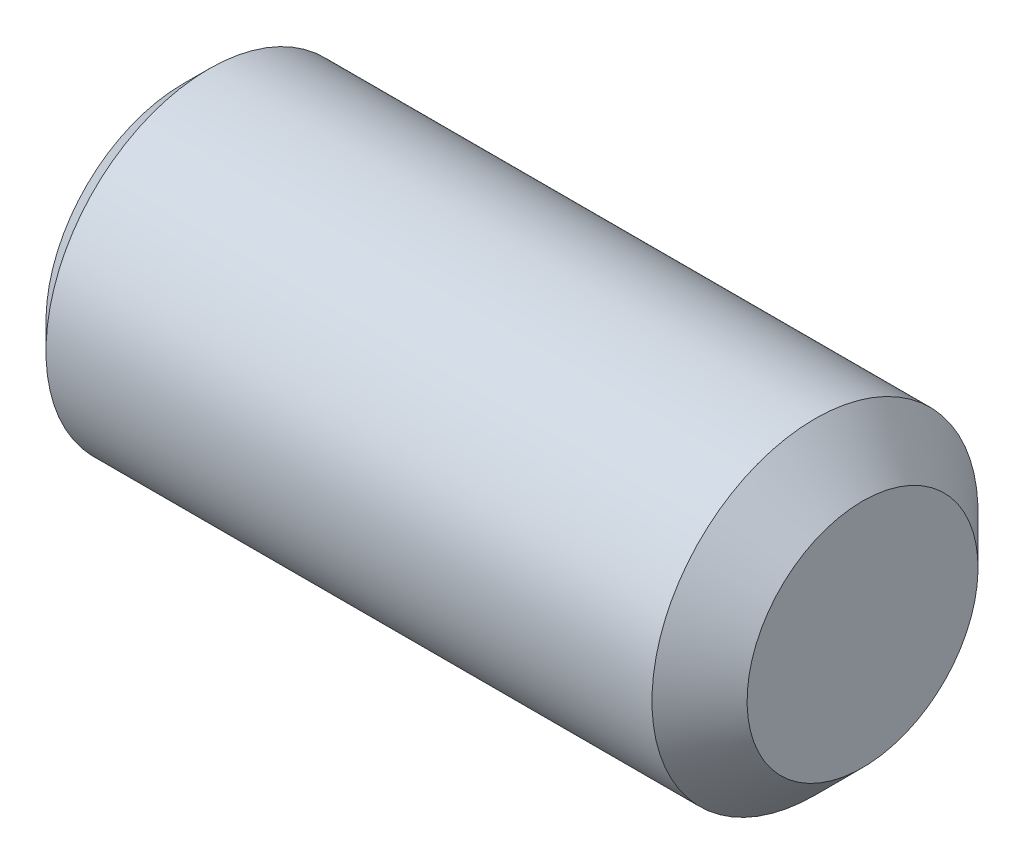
ISO-10303-21;
HEADER;
FILE_DESCRIPTION(('STEP AP214'),'2;1');
FILE_NAME('part.step','',(''),(''),'','','');
FILE_SCHEMA(('AUTOMOTIVE_DESIGN { 1 0 10303 214 1 1 1 1 }'));
ENDSEC;
DATA;
#1=APPLICATION_CONTEXT('core data for automotive mechanical design processes');
#2=APPLICATION_PROTOCOL_DEFINITION('international standard','automotive_design',2000,#1);
#3=PRODUCT_CONTEXT('',#1,'mechanical');
#4=PRODUCT('Part','Part','',(#3));
#5=PRODUCT_RELATED_PRODUCT_CATEGORY('part','',(#4));
#6=PRODUCT_DEFINITION_FORMATION('','',#4);
#7=PRODUCT_DEFINITION_CONTEXT('part definition',#1,'design');
#8=PRODUCT_DEFINITION('design','',#6,#7);
#9=PRODUCT_DEFINITION_SHAPE('','',#8);
#10=(LENGTH_UNIT() NAMED_UNIT(*) SI_UNIT(.MILLI.,.METRE.));
#11=(NAMED_UNIT(*) PLANE_ANGLE_UNIT() SI_UNIT($,.RADIAN.));
#12=(NAMED_UNIT(*) SI_UNIT($,.STERADIAN.) SOLID_ANGLE_UNIT());
#13=UNCERTAINTY_MEASURE_WITH_UNIT(LENGTH_MEASURE(1.E-05),#10,'distance_accuracy_value','');
#14=(GEOMETRIC_REPRESENTATION_CONTEXT(3) GLOBAL_UNCERTAINTY_ASSIGNED_CONTEXT((#13)) GLOBAL_UNIT_ASSIGNED_CONTEXT((#10,
#11,#12)) REPRESENTATION_CONTEXT('',''));
#15=CARTESIAN_POINT('',(0.,0.,0.));
#16=DIRECTION('',(0.,0.,1.));
#17=DIRECTION('',(1.,0.,0.));
#18=AXIS2_PLACEMENT_3D('',#15,#16,#17);
#19=CARTESIAN_POINT('',(15.877293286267,2.80372811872,1.696454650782));
#20=DIRECTION('',(1.,0.,0.));
#21=DIRECTION('',(0.,1.,0.));
#22=AXIS2_PLACEMENT_3D('',#19,#20,#21);
#23=PLANE('',#22);
#24=CARTESIAN_POINT('',(15.877293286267,2.80372811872,1.696454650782));
#25=DIRECTION('',(1.,0.,0.));
#26=DIRECTION('',(0.,1.,0.));
#27=AXIS2_PLACEMENT_3D('',#24,#25,#26);
#28=CIRCLE('',#27,4.25);
#29=CARTESIAN_POINT('',(15.877293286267,7.05372811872,1.696454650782));
#30=VERTEX_POINT('',#29);
#31=EDGE_CURVE('E10',#30,#30,#28,.T.);
#32=ORIENTED_EDGE('',*,*,#31,.T.);
#33=EDGE_LOOP('',(#32));
#34=FACE_BOUND('',#33,.T.);
#35=ADVANCED_FACE('F16',(#34),#23,.T.);
#36=CARTESIAN_POINT('',(15.002293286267,2.80372811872,1.696454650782));
#37=DIRECTION('',(-1.,0.,0.));
#38=DIRECTION('',(0.,-1.,0.));
#39=AXIS2_PLACEMENT_3D('',#36,#37,#38);
#40=CONICAL_SURFACE('',#39,5.125,0.785398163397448);
#41=ORIENTED_EDGE('',*,*,#31,.F.);
#42=EDGE_LOOP('',(#41));
#43=FACE_BOUND('',#42,.T.);
#44=CARTESIAN_POINT('',(14.127293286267,2.80372811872,1.696454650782));
#45=DIRECTION('',(1.,0.,0.));
#46=DIRECTION('',(0.,1.,0.));
#47=AXIS2_PLACEMENT_3D('',#44,#45,#46);
#48=CIRCLE('',#47,6.);
#49=CARTESIAN_POINT('',(14.127293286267,8.80372811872,1.696454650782));
#50=VERTEX_POINT('',#49);
#51=EDGE_CURVE('E27',#50,#50,#48,.T.);
#52=ORIENTED_EDGE('',*,*,#51,.T.);
#53=EDGE_LOOP('',(#52));
#54=FACE_BOUND('',#53,.T.);
#55=ADVANCED_FACE('F308',(#43,#54),#40,.T.);
#56=CARTESIAN_POINT('',(-1.122706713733,2.80372811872,1.696454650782));
#57=DIRECTION('',(-1.,0.,0.));
#58=DIRECTION('',(0.,0.,1.));
#59=AXIS2_PLACEMENT_3D('',#56,#57,#58);
#60=PLANE('',#59);
#61=DIRECTION('',(0.,-0.500000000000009,-0.866025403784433));
#62=VECTOR('',#61,1.);
#63=CARTESIAN_POINT('',(-1.122706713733,6.26782973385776,1.69645465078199));
#64=LINE('',#63,#62);
#65=CARTESIAN_POINT('',(-1.122706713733,6.26782973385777,1.696454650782));
#66=VERTEX_POINT('',#65);
#67=CARTESIAN_POINT('',(-1.122706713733,4.53577892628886,-1.303545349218));
#68=VERTEX_POINT('',#67);
#69=EDGE_CURVE('E20',#66,#68,#64,.T.);
#70=ORIENTED_EDGE('',*,*,#69,.T.);
#71=DIRECTION('',(0.,-1.,0.));
#72=VECTOR('',#71,1.);
#73=CARTESIAN_POINT('',(-1.122706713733,4.53577892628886,-1.303545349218));
#74=LINE('',#73,#72);
#75=CARTESIAN_POINT('',(-1.122706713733,1.07167731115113,-1.303545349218));
#76=VERTEX_POINT('',#75);
#77=EDGE_CURVE('E101',#68,#76,#74,.T.);
#78=ORIENTED_EDGE('',*,*,#77,.T.);
#79=DIRECTION('',(0.,-0.5,0.866025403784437));
#80=VECTOR('',#79,1.);
#81=CARTESIAN_POINT('',(-1.122706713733,1.07167731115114,-1.303545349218));
#82=LINE('',#81,#80);
#83=CARTESIAN_POINT('',(-1.122706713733,-0.66037349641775,1.696454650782));
#84=VERTEX_POINT('',#83);
#85=EDGE_CURVE('E158',#76,#84,#82,.T.);
#86=ORIENTED_EDGE('',*,*,#85,.T.);
#87=DIRECTION('',(0.,0.499999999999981,0.86602540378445));
#88=VECTOR('',#87,1.);
#89=CARTESIAN_POINT('',(-1.122706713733,-0.66037349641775,1.696454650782));
#90=LINE('',#89,#88);
#91=CARTESIAN_POINT('',(-1.122706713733,1.07167731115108,4.696454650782));
#92=VERTEX_POINT('',#91);
#93=EDGE_CURVE('E143',#84,#92,#90,.T.);
#94=ORIENTED_EDGE('',*,*,#93,.T.);
#95=DIRECTION('',(0.,1.,0.));
#96=VECTOR('',#95,1.);
#97=CARTESIAN_POINT('',(-1.122706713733,1.07167731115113,4.696454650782));
#98=LINE('',#97,#96);
#99=CARTESIAN_POINT('',(-1.122706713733,4.53577892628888,4.69645465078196));
#100=VERTEX_POINT('',#99);
#101=EDGE_CURVE('E180',#92,#100,#98,.T.);
#102=ORIENTED_EDGE('',*,*,#101,.T.);
#103=DIRECTION('',(0.,0.500000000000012,-0.866025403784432));
#104=VECTOR('',#103,1.);
#105=CARTESIAN_POINT('',(-1.122706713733,4.53577892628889,4.69645465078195));
#106=LINE('',#105,#104);
#107=EDGE_CURVE('E92',#100,#66,#106,.T.);
#108=ORIENTED_EDGE('',*,*,#107,.T.);
#109=EDGE_LOOP('',(#70,#78,#86,#94,#102,#108));
#110=FACE_BOUND('',#109,.T.);
#111=ADVANCED_FACE('F18',(#110),#60,.T.);
#112=CARTESIAN_POINT('',(-8.17549142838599,2.80372811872,1.696454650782));
#113=DIRECTION('',(1.,0.,0.));
#114=DIRECTION('',(0.,1.,0.));
#115=AXIS2_PLACEMENT_3D('',#112,#113,#114);
#116=CYLINDRICAL_SURFACE('',#115,6.);
#117=ORIENTED_EDGE('',*,*,#51,.F.);
#118=EDGE_LOOP('',(#117));
#119=FACE_BOUND('',#118,.T.);
#120=CARTESIAN_POINT('',(-8.17549142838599,2.80372811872,1.696454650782));
#121=DIRECTION('',(1.,0.,0.));
#122=DIRECTION('',(0.,1.,0.));
#123=AXIS2_PLACEMENT_3D('',#120,#121,#122);
#124=CIRCLE('',#123,6.);
#125=CARTESIAN_POINT('',(-8.17549142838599,8.80372811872,1.696454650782));
#126=VERTEX_POINT('',#125);
#127=EDGE_CURVE('E130',#126,#126,#124,.T.);
#128=ORIENTED_EDGE('',*,*,#127,.T.);
#129=EDGE_LOOP('',(#128));
#130=FACE_BOUND('',#129,.T.);
#131=ADVANCED_FACE('F317',(#119,#130),#116,.T.);
#132=CARTESIAN_POINT('',(-8.53011880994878,2.80372811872,1.696454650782));
#133=DIRECTION('',(-1.,0.,0.));
#134=DIRECTION('',(0.,-1.,0.));
#135=AXIS2_PLACEMENT_3D('',#132,#133,#134);
#136=CONICAL_SURFACE('',#135,4.026392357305,1.0471975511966);
#137=CARTESIAN_POINT('',(-8.20548010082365,4.53577892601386,4.69645465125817));
#138=CARTESIAN_POINT('',(-8.20063730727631,4.54416689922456,4.68192625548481));
#139=CARTESIAN_POINT('',(-8.19099572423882,4.56105037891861,4.65268321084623));
#140=CARTESIAN_POINT('',(-8.17675918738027,4.58655868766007,4.60850152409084));
#141=CARTESIAN_POINT('',(-8.16263851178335,4.61248183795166,4.56360131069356));
#142=CARTESIAN_POINT('',(-8.14865833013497,4.63882102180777,4.51798050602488));
#143=CARTESIAN_POINT('',(-8.13310004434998,4.66895645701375,4.46578440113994));
#144=CARTESIAN_POINT('',(-8.1144819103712,4.70630695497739,4.40109144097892));
#145=CARTESIAN_POINT('',(-8.09132186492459,4.75516583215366,4.31646538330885));
#146=CARTESIAN_POINT('',(-8.06550616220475,4.81363476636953,4.21519421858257));
#147=CARTESIAN_POINT('',(-8.04044675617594,4.87596923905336,4.10722774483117));
#148=CARTESIAN_POINT('',(-8.01917204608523,4.93485583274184,4.00523317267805));
#149=CARTESIAN_POINT('',(-8.00279542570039,4.98537438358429,3.91773247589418));
#150=CARTESIAN_POINT('',(-7.98978125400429,5.02987279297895,3.84065896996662));
#151=CARTESIAN_POINT('',(-7.97869607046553,5.07195688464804,3.76776718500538));
#152=CARTESIAN_POINT('',(-7.96856697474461,5.11546163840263,3.69241474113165));
#153=CARTESIAN_POINT('',(-7.95945885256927,5.16091293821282,3.61369078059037));
#154=CARTESIAN_POINT('',(-7.95166113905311,5.20786895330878,3.5323605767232));
#155=CARTESIAN_POINT('',(-7.94535460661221,5.2563250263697,3.44843219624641));
#156=CARTESIAN_POINT('',(-7.94075696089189,5.30577435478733,3.36278344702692));
#157=CARTESIAN_POINT('',(-7.93809713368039,5.35443863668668,3.27849443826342));
#158=CARTESIAN_POINT('',(-7.9374991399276,5.38832642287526,3.21979907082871));
#159=CARTESIAN_POINT('',(-7.93757036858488,5.42258608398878,3.16045959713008));
#160=CARTESIAN_POINT('',(-7.93844703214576,5.4591061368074,3.09720501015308));
#161=CARTESIAN_POINT('',(-7.94180737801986,5.5115977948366,3.006286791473));
#162=CARTESIAN_POINT('',(-7.94738342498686,5.56496821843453,2.9138465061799));
#163=CARTESIAN_POINT('',(-7.95521348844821,5.61891325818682,2.82041095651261));
#164=CARTESIAN_POINT('',(-7.96530293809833,5.67326089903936,2.72627808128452));
#165=CARTESIAN_POINT('',(-7.97758455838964,5.72770487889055,2.63197834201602));
#166=CARTESIAN_POINT('',(-7.99201507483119,5.78221265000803,2.53756811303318));
#167=CARTESIAN_POINT('',(-8.00850762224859,5.83665128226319,2.4432776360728));
#168=CARTESIAN_POINT('',(-8.02698948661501,5.89099685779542,2.34914833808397));
#169=CARTESIAN_POINT('',(-8.04736912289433,5.94520120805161,2.25526364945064));
#170=CARTESIAN_POINT('',(-8.06957819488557,5.99928745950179,2.1615835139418));
#171=CARTESIAN_POINT('',(-8.09353879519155,6.05325581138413,2.06810758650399));
#172=CARTESIAN_POINT('',(-8.11917131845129,6.10710587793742,1.97483653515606));
#173=CARTESIAN_POINT('',(-8.14639537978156,6.16083557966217,1.88177396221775));
#174=CARTESIAN_POINT('',(-8.17513052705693,6.21444250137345,1.78892404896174));
#175=CARTESIAN_POINT('',(-8.19521536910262,6.2500505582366,1.72724908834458));
#176=CARTESIAN_POINT('',(-8.20548010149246,6.26782973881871,1.69645464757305));
#177=(BOUNDED_CURVE() B_SPLINE_CURVE(3,(#137,#138,#139,#140,#141,#142,#143,#144,#145,#146,#147,
#148,#149,#150,#151,#152,#153,#154,#155,#156,#157,#158,#159,#160,#161,#162,#163,#164,#165,#166,
#167,#168,#169,#170,#171,#172,#173,#174,#175,#176),.UNSPECIFIED.,.F.,
.F.) B_SPLINE_CURVE_WITH_KNOTS((4,1,1,1,1,1,1,1,1,1,1,1,1,1,1,1,1,1,1,1,1,1,1,1,1,1,1,1,1,1,1,1,
1,1,1,1,1,4),(0.,0.0149058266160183,0.0299738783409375,0.0451999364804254,0.0607545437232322,
0.0764711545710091,0.0982995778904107,0.126423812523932,0.162134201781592,0.200462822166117,
0.234916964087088,0.264240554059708,0.287778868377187,0.311629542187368,0.336627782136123,
0.362458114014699,0.389510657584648,0.416964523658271,0.445261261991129,0.473935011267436,
0.500001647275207,0.503073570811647,0.532385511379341,0.562314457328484,0.592679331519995,
0.623561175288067,0.65457172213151,0.68575580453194,0.716970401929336,0.74829502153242,
0.7796008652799,0.810931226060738,0.842309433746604,0.873730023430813,0.905197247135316,
0.936733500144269,0.968333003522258,1.),
.UNSPECIFIED.) CURVE() GEOMETRIC_REPRESENTATION_ITEM() RATIONAL_B_SPLINE_CURVE((1.,1.,1.,1.,1.,
1.,1.,1.,1.,1.,1.,1.,1.,1.,1.,1.,1.,1.,1.,1.,1.,1.,1.,1.,1.,1.,1.,1.,1.,1.,1.,1.,1.,1.,1.,1.,1.,
1.,1.,1.)) REPRESENTATION_ITEM(''));
#178=CARTESIAN_POINT('',(-8.2054801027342,4.53577892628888,4.69645465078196));
#179=VERTEX_POINT('',#178);
#180=CARTESIAN_POINT('',(-8.20548010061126,6.26782973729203,1.6964546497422));
#181=VERTEX_POINT('',#180);
#182=EDGE_CURVE('E172',#179,#181,#177,.T.);
#183=ORIENTED_EDGE('',*,*,#182,.F.);
#184=CARTESIAN_POINT('',(-8.20548009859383,1.07167731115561,4.69645465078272));
#185=CARTESIAN_POINT('',(-8.20063730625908,1.08845325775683,4.69645465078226));
#186=CARTESIAN_POINT('',(-8.19099572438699,1.12222021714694,4.69645465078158));
#187=CARTESIAN_POINT('',(-8.17675918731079,1.17323683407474,4.69645465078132));
#188=CARTESIAN_POINT('',(-8.1648353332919,1.21701715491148,4.69645465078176));
#189=CARTESIAN_POINT('',(-8.15552841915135,1.25187449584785,4.69645465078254));
#190=CARTESIAN_POINT('',(-8.14619075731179,1.28732057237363,4.69645465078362));
#191=CARTESIAN_POINT('',(-8.13310004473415,1.33803237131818,4.69645465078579));
#192=CARTESIAN_POINT('',(-8.11448191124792,1.41273336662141,4.6964546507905));
#193=CARTESIAN_POINT('',(-8.09132186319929,1.51045111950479,4.69645465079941));
#194=CARTESIAN_POINT('',(-8.07100445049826,1.60248333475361,4.69645465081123));
#195=CARTESIAN_POINT('',(-8.05343065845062,1.68746376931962,4.69645465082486));
#196=CARTESIAN_POINT('',(-8.03699433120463,1.77117002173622,4.6964546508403));
#197=CARTESIAN_POINT('',(-8.01917204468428,1.8698311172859,4.69645465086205));
#198=CARTESIAN_POINT('',(-8.00456103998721,1.9599751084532,4.69645465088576));
#199=CARTESIAN_POINT('',(-7.99542452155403,2.02127380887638,4.69645465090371));
#200=CARTESIAN_POINT('',(-7.98795066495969,2.07394573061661,4.69645465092));
#201=CARTESIAN_POINT('',(-7.98283324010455,2.11262026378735,4.69645465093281));
#202=CARTESIAN_POINT('',(-7.97832006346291,2.14876571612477,4.69645465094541));
#203=CARTESIAN_POINT('',(-7.97448350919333,2.18021921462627,4.69645465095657));
#204=CARTESIAN_POINT('',(-7.97106787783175,2.21015203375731,4.69645465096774));
#205=CARTESIAN_POINT('',(-7.96556319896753,2.2610215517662,4.6964546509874));
#206=CARTESIAN_POINT('',(-7.96116343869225,2.30503106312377,4.69645465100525));
#207=CARTESIAN_POINT('',(-7.95579911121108,2.3660211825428,4.69645465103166));
#208=CARTESIAN_POINT('',(-7.95075678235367,2.42975484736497,4.69645465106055));
#209=CARTESIAN_POINT('',(-7.94535459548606,2.51276950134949,4.69645465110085));
#210=CARTESIAN_POINT('',(-7.94215360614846,2.58162560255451,4.69645465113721));
#211=CARTESIAN_POINT('',(-7.93975355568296,2.64838426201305,4.69645465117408));
#212=CARTESIAN_POINT('',(-7.93806581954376,2.71254664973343,4.69645465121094));
#213=CARTESIAN_POINT('',(-7.93749913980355,2.77677229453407,4.69645465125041));
#214=CARTESIAN_POINT('',(-7.93757036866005,2.84529161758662,4.69645465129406));
#215=CARTESIAN_POINT('',(-7.93844703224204,2.91833172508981,4.69645465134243));
#216=CARTESIAN_POINT('',(-7.94180737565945,3.02331500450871,4.69645465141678));
#217=CARTESIAN_POINT('',(-7.94550849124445,3.09416450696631,4.69645465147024));
#218=CARTESIAN_POINT('',(-7.94997957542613,3.16582812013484,4.69645465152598));
#219=CARTESIAN_POINT('',(-7.95523779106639,3.23820778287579,4.69645465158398));
#220=CARTESIAN_POINT('',(-7.9653029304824,3.34664123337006,4.69645465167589));
#221=CARTESIAN_POINT('',(-7.9746123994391,3.42917814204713,4.69645465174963));
#222=CARTESIAN_POINT('',(-7.98178868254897,3.48646575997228,4.69645465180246));
#223=CARTESIAN_POINT('',(-7.98626237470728,3.52064652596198,4.69645465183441));
#224=CARTESIAN_POINT('',(-7.98987015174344,3.54692246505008,4.69645465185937));
#225=CARTESIAN_POINT('',(-7.99528825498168,3.58525735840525,4.69645465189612));
#226=CARTESIAN_POINT('',(-8.00098240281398,3.6237437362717,4.69645465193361));
#227=CARTESIAN_POINT('',(-8.01240442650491,3.69633884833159,4.69645465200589));
#228=CARTESIAN_POINT('',(-8.02091517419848,3.74639037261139,4.69645465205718));
#229=CARTESIAN_POINT('',(-8.033873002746,3.81872977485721,4.69645465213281));
#230=CARTESIAN_POINT('',(-8.04747503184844,3.89103772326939,4.69645465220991));
#231=CARTESIAN_POINT('',(-8.06789658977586,3.99050386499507,4.69645465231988));
#232=CARTESIAN_POINT('',(-8.08372883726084,4.06243961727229,4.69645465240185));
#233=CARTESIAN_POINT('',(-8.10013352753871,4.13434014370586,4.69645465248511));
#234=CARTESIAN_POINT('',(-8.11917131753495,4.21433120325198,4.69645465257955));
#235=CARTESIAN_POINT('',(-8.14461727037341,4.31477206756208,4.69645465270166));
#236=CARTESIAN_POINT('',(-8.16365929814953,4.38620402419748,4.69645465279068));
#237=CARTESIAN_POINT('',(-8.18320065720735,4.45761929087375,4.69645465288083));
#238=CARTESIAN_POINT('',(-8.19521532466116,4.50022056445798,4.69645465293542));
#239=CARTESIAN_POINT('',(-8.20548009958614,4.53577892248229,4.69645465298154));
#240=(BOUNDED_CURVE() B_SPLINE_CURVE(3,(#184,#185,#186,#187,#188,#189,#190,#191,#192,#193,#194,
#195,#196,#197,#198,#199,#200,#201,#202,#203,#204,#205,#206,#207,#208,#209,#210,#211,#212,#213,
#214,#215,#216,#217,#218,#219,#220,#221,#222,#223,#224,#225,#226,#227,#228,#229,#230,#231,#232,
#233,#234,#235,#236,#237,#238,#239),.UNSPECIFIED.,.F.,.F.) B_SPLINE_CURVE_WITH_KNOTS((4,1,1,1,1,
1,1,1,1,1,1,1,1,1,1,1,1,1,1,1,1,1,1,1,1,1,1,1,1,1,1,1,1,1,1,1,1,1,1,1,1,1,1,1,1,1,1,1,1,1,1,1,1,
4),(0.,0.0149058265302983,0.0299738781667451,0.0451999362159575,0.0536216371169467,
0.0607545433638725,0.0764711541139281,0.0982995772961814,0.126423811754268,0.162134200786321,
0.178703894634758,0.200462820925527,0.234916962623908,0.264240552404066,0.278365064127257,
0.287778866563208,0.30961167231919,0.311629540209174,0.318836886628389,0.336627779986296,
0.337314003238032,0.362458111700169,0.374332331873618,0.389510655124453,0.416964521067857,
0.44526125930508,0.448289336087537,0.473935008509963,0.500001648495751,0.503073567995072,
0.532385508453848,0.562314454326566,0.592679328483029,0.592903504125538,0.623561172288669,
0.654571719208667,0.685755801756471,0.694365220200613,0.703784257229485,0.715137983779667,
0.716970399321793,0.736781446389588,0.748295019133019,0.779600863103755,0.780049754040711,
0.810931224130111,0.842309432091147,0.866602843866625,0.873730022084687,0.905197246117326,
0.936733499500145,0.962154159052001,0.968333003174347,1.),
.UNSPECIFIED.) CURVE() GEOMETRIC_REPRESENTATION_ITEM() RATIONAL_B_SPLINE_CURVE((1.,1.,1.,1.,1.,
1.,1.,1.,1.,1.,1.,1.,1.,1.,1.,1.,1.,1.,1.,1.,1.,1.,1.,1.,1.,1.,1.,1.,1.,1.,1.,1.,1.,1.,1.,1.,1.,
1.,1.,1.,1.,1.,1.,1.,1.,1.,1.,1.,1.,1.,1.,1.,1.,1.,1.,1.)) REPRESENTATION_ITEM(''));
#241=CARTESIAN_POINT('',(-8.20548009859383,1.07167731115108,4.696454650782));
#242=VERTEX_POINT('',#241);
#243=EDGE_CURVE('E165',#242,#179,#240,.T.);
#244=ORIENTED_EDGE('',*,*,#243,.F.);
#245=CARTESIAN_POINT('',(-8.20548009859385,-0.66037349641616,1.69645465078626));
#246=CARTESIAN_POINT('',(-8.20063730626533,-0.65198552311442,1.71098304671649));
#247=CARTESIAN_POINT('',(-8.19099572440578,-0.63510204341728,1.74022609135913));
#248=CARTESIAN_POINT('',(-8.17675918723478,-0.60959373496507,1.78440777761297));
#249=CARTESIAN_POINT('',(-8.16263851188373,-0.58367058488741,1.82930799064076));
#250=CARTESIAN_POINT('',(-8.14865833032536,-0.55733140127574,1.87492879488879));
#251=CARTESIAN_POINT('',(-8.13310004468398,-0.5271959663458,1.92712489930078));
#252=CARTESIAN_POINT('',(-8.11448191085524,-0.48984546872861,1.99181785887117));
#253=CARTESIAN_POINT('',(-8.09132186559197,-0.44098659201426,2.07644391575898));
#254=CARTESIAN_POINT('',(-8.06550616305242,-0.38251765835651,2.17771507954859));
#255=CARTESIAN_POINT('',(-8.04044675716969,-0.32018318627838,2.28568155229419));
#256=CARTESIAN_POINT('',(-8.01917204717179,-0.26129659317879,2.38767612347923));
#257=CARTESIAN_POINT('',(-8.00279542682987,-0.21077804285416,2.47517681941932));
#258=CARTESIAN_POINT('',(-7.98978125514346,-0.16627963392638,2.55225032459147));
#259=CARTESIAN_POINT('',(-7.97869607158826,-0.12419554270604,2.62514210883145));
#260=CARTESIAN_POINT('',(-7.96856697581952,-0.08069078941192,2.70049455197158));
#261=CARTESIAN_POINT('',(-7.95945885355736,-0.03523949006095,2.77921851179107));
#262=CARTESIAN_POINT('',(-7.95166113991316,0.0117165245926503,2.86054871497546));
#263=CARTESIAN_POINT('',(-7.94535460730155,0.06017259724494,2.94447709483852));
#264=CARTESIAN_POINT('',(-7.94075696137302,0.10962192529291,3.03012584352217));
#265=CARTESIAN_POINT('',(-7.93809713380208,0.15828620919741,3.11441485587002));
#266=CARTESIAN_POINT('',(-7.93749913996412,0.19217399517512,3.17311022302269));
#267=CARTESIAN_POINT('',(-7.93757036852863,0.22643365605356,3.2324496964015));
#268=CARTESIAN_POINT('',(-7.93844703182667,0.262953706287,3.29570427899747));
#269=CARTESIAN_POINT('',(-7.9418073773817,0.31544536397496,3.38662249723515));
#270=CARTESIAN_POINT('',(-7.94738342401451,0.36881578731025,3.47906278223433));
#271=CARTESIAN_POINT('',(-7.95521348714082,0.4227608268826,3.57249833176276));
#272=CARTESIAN_POINT('',(-7.9653029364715,0.47710846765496,3.66663120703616));
#273=CARTESIAN_POINT('',(-7.97758455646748,0.53155244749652,3.76093094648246));
#274=CARTESIAN_POINT('',(-7.99201507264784,0.5860602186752,3.85534117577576));
#275=CARTESIAN_POINT('',(-8.00850761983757,0.640498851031,3.94963165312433));
#276=CARTESIAN_POINT('',(-8.02698948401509,0.69484442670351,4.04376095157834));
#277=CARTESIAN_POINT('',(-8.04736912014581,0.74904877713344,4.13764564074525));
#278=CARTESIAN_POINT('',(-8.06957819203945,0.80313502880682,4.23132577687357));
#279=CARTESIAN_POINT('',(-8.09353879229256,0.85710338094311,4.32480170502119));
#280=CARTESIAN_POINT('',(-8.11917131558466,0.91095344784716,4.41807275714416));
#281=CARTESIAN_POINT('',(-8.14639537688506,0.96468314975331,4.5111353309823));
#282=CARTESIAN_POINT('',(-8.17513052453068,1.01829007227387,4.6039852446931));
#283=CARTESIAN_POINT('',(-8.19521536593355,1.05389812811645,4.66566020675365));
#284=CARTESIAN_POINT('',(-8.20548009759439,1.07167730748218,4.69645464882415));
#285=(BOUNDED_CURVE() B_SPLINE_CURVE(3,(#245,#246,#247,#248,#249,#250,#251,#252,#253,#254,#255,
#256,#257,#258,#259,#260,#261,#262,#263,#264,#265,#266,#267,#268,#269,#270,#271,#272,#273,#274,
#275,#276,#277,#278,#279,#280,#281,#282,#283,#284),.UNSPECIFIED.,.F.,
.F.) B_SPLINE_CURVE_WITH_KNOTS((4,1,1,1,1,1,1,1,1,1,1,1,1,1,1,1,1,1,1,1,1,1,1,1,1,1,1,1,1,1,1,1,
1,1,1,1,1,4),(0.,0.0149058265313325,0.0299738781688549,0.0451999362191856,0.0607545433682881,
0.0764711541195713,0.0982995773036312,0.126423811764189,0.162134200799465,0.20046282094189,
0.234916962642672,0.264240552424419,0.287778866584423,0.311629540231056,0.336627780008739,
0.362458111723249,0.389510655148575,0.416964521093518,0.445261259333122,0.473935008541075,
0.500001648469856,0.503073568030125,0.532385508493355,0.56231445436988,0.592679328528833,
0.623561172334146,0.654571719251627,0.685755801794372,0.71697039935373,0.748295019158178,
0.7796008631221,0.810931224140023,0.8423094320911,0.873730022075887,0.905197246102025,
0.936733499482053,0.968333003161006,1.),
.UNSPECIFIED.) CURVE() GEOMETRIC_REPRESENTATION_ITEM() RATIONAL_B_SPLINE_CURVE((1.,1.,1.,1.,1.,
1.,1.,1.,1.,1.,1.,1.,1.,1.,1.,1.,1.,1.,1.,1.,1.,1.,1.,1.,1.,1.,1.,1.,1.,1.,1.,1.,1.,1.,1.,1.,1.,
1.,1.,1.)) REPRESENTATION_ITEM(''));
#286=CARTESIAN_POINT('',(-8.20548009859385,-0.66037349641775,1.696454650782));
#287=VERTEX_POINT('',#286);
#288=EDGE_CURVE('E188',#287,#242,#285,.T.);
#289=ORIENTED_EDGE('',*,*,#288,.F.);
#290=CARTESIAN_POINT('',(-8.20548009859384,1.07167731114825,-1.30354534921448));
#291=CARTESIAN_POINT('',(-8.20063730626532,1.0632893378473,-1.28901695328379));
#292=CARTESIAN_POINT('',(-8.19099572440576,1.04640585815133,-1.25977390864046));
#293=CARTESIAN_POINT('',(-8.17675918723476,1.02089754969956,-1.21559222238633));
#294=CARTESIAN_POINT('',(-8.1626385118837,0.99497439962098,-1.17069200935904));
#295=CARTESIAN_POINT('',(-8.14865833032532,0.96863521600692,-1.12507120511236));
#296=CARTESIAN_POINT('',(-8.13310004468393,0.93849978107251,-1.07287510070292));
#297=CARTESIAN_POINT('',(-8.11448191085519,0.90114928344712,-1.00818214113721));
#298=CARTESIAN_POINT('',(-8.09132186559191,0.85229040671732,-0.92355608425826));
#299=CARTESIAN_POINT('',(-8.06550616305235,0.79382147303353,-0.82228492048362));
#300=CARTESIAN_POINT('',(-8.04044675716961,0.73148700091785,-0.71431844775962));
#301=CARTESIAN_POINT('',(-8.0191720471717,0.67260040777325,-0.61232387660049));
#302=CARTESIAN_POINT('',(-8.00279542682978,0.62208185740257,-0.52482318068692));
#303=CARTESIAN_POINT('',(-7.98978125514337,0.57758344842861,-0.44774967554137));
#304=CARTESIAN_POINT('',(-7.97869607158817,0.53549935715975,-0.37485789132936));
#305=CARTESIAN_POINT('',(-7.96856697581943,0.49199460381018,-0.29950544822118));
#306=CARTESIAN_POINT('',(-7.95945885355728,0.44654330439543,-0.22078148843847));
#307=CARTESIAN_POINT('',(-7.95166113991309,0.39958728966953,-0.13945128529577));
#308=CARTESIAN_POINT('',(-7.94535460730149,0.35113121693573,-0.05552290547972));
#309=CARTESIAN_POINT('',(-7.94075696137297,0.30168188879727,0.0301258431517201));
#310=CARTESIAN_POINT('',(-7.93809713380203,0.25301760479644,0.11441485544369));
#311=CARTESIAN_POINT('',(-7.93749913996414,0.21912981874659,0.17311022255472));
#312=CARTESIAN_POINT('',(-7.93757036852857,0.18487015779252,0.23244969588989));
#313=CARTESIAN_POINT('',(-7.93844703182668,0.14835010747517,0.29570427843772));
#314=CARTESIAN_POINT('',(-7.94180737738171,0.0958584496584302,0.38662249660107));
#315=CARTESIAN_POINT('',(-7.94738342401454,0.0424880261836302,0.47906278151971));
#316=CARTESIAN_POINT('',(-7.95521348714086,-0.0114570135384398,0.5724983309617));
#317=CARTESIAN_POINT('',(-7.96530293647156,-0.0658046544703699,0.66663120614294));
#318=CARTESIAN_POINT('',(-7.97758455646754,-0.12024863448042,0.76093094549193));
#319=CARTESIAN_POINT('',(-7.99201507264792,-0.17475640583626,0.855341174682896));
#320=CARTESIAN_POINT('',(-8.00850761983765,-0.22919503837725,0.949631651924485));
#321=CARTESIAN_POINT('',(-8.02698948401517,-0.28354061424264,1.04376095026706));
#322=CARTESIAN_POINT('',(-8.04736912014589,-0.33774496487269,1.13764563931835));
#323=CARTESIAN_POINT('',(-8.06957819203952,-0.39183121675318,1.23132577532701));
#324=CARTESIAN_POINT('',(-8.09353879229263,-0.44579956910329,1.3248017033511));
#325=CARTESIAN_POINT('',(-8.11917131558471,-0.49964963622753,1.41807275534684));
#326=CARTESIAN_POINT('',(-8.1463953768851,-0.55337933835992,1.51113532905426));
#327=CARTESIAN_POINT('',(-8.17513052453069,-0.60698626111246,1.60398524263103));
#328=CARTESIAN_POINT('',(-8.19521536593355,-0.6425943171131,1.66566020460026));
#329=CARTESIAN_POINT('',(-8.20548009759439,-0.66037349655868,1.69645464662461));
#330=(BOUNDED_CURVE() B_SPLINE_CURVE(3,(#290,#291,#292,#293,#294,#295,#296,#297,#298,#299,#300,
#301,#302,#303,#304,#305,#306,#307,#308,#309,#310,#311,#312,#313,#314,#315,#316,#317,#318,#319,
#320,#321,#322,#323,#324,#325,#326,#327,#328,#329),.UNSPECIFIED.,.F.,
.F.) B_SPLINE_CURVE_WITH_KNOTS((4,1,1,1,1,1,1,1,1,1,1,1,1,1,1,1,1,1,1,1,1,1,1,1,1,1,1,1,1,1,1,1,
1,1,1,1,1,4),(0.,0.0149058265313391,0.0299738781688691,0.045199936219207,0.0607545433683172,
0.0764711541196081,0.0982995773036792,0.12642381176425,0.162134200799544,0.200462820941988,
0.234916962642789,0.264240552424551,0.287778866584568,0.311629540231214,0.336627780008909,
0.362458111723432,0.389510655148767,0.416964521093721,0.445261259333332,0.473935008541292,
0.50000164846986,0.503073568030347,0.532385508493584,0.562314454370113,0.592679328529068,
0.623561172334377,0.654571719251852,0.685755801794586,0.716970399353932,0.748295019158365,
0.77960086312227,0.810931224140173,0.842309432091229,0.873730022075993,0.905197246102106,
0.936733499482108,0.968333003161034,1.),
.UNSPECIFIED.) CURVE() GEOMETRIC_REPRESENTATION_ITEM() RATIONAL_B_SPLINE_CURVE((1.,1.,1.,1.,1.,
1.,1.,1.,1.,1.,1.,1.,1.,1.,1.,1.,1.,1.,1.,1.,1.,1.,1.,1.,1.,1.,1.,1.,1.,1.,1.,1.,1.,1.,1.,1.,1.,
1.,1.,1.)) REPRESENTATION_ITEM(''));
#331=CARTESIAN_POINT('',(-8.20548009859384,1.07167731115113,-1.303545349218));
#332=VERTEX_POINT('',#331);
#333=EDGE_CURVE('E114',#332,#287,#330,.T.);
#334=ORIENTED_EDGE('',*,*,#333,.F.);
#335=CARTESIAN_POINT('',(-8.20548009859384,4.53577892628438,-1.30354534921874));
#336=CARTESIAN_POINT('',(-8.20063730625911,4.51900297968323,-1.30354534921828));
#337=CARTESIAN_POINT('',(-8.19099572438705,4.48523602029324,-1.3035453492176));
#338=CARTESIAN_POINT('',(-8.1767591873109,4.43421940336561,-1.30354534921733));
#339=CARTESIAN_POINT('',(-8.16483533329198,4.39043908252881,-1.30354534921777));
#340=CARTESIAN_POINT('',(-8.15552841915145,4.35558174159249,-1.30354534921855));
#341=CARTESIAN_POINT('',(-8.14619075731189,4.32013566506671,-1.30354534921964));
#342=CARTESIAN_POINT('',(-8.13310004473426,4.26942386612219,-1.3035453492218));
#343=CARTESIAN_POINT('',(-8.11448191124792,4.19472287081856,-1.30354534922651));
#344=CARTESIAN_POINT('',(-8.09132186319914,4.09700511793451,-1.30354534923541));
#345=CARTESIAN_POINT('',(-8.07100445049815,4.0049729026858,-1.30354534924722));
#346=CARTESIAN_POINT('',(-8.05343065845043,3.91999246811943,-1.30354534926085));
#347=CARTESIAN_POINT('',(-8.03699433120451,3.8362862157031,-1.30354534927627));
#348=CARTESIAN_POINT('',(-8.01917204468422,3.73762512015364,-1.30354534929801));
#349=CARTESIAN_POINT('',(-8.00456103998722,3.64748112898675,-1.3035453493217));
#350=CARTESIAN_POINT('',(-7.99542452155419,3.58618242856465,-1.30354534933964));
#351=CARTESIAN_POINT('',(-7.98795066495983,3.53351050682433,-1.30354534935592));
#352=CARTESIAN_POINT('',(-7.98283324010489,3.49483597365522,-1.30354534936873));
#353=CARTESIAN_POINT('',(-7.97832006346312,3.45869052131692,-1.30354534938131));
#354=CARTESIAN_POINT('',(-7.97448350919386,3.42723702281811,-1.30354534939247));
#355=CARTESIAN_POINT('',(-7.97106787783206,3.39730420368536,-1.30354534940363));
#356=CARTESIAN_POINT('',(-7.96556319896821,3.34643468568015,-1.30354534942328));
#357=CARTESIAN_POINT('',(-7.9611634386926,3.30242517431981,-1.30354534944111));
#358=CARTESIAN_POINT('',(-7.95579911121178,3.24143505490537,-1.30354534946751));
#359=CARTESIAN_POINT('',(-7.95075678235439,3.17770139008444,-1.30354534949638));
#360=CARTESIAN_POINT('',(-7.94535459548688,3.09468673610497,-1.30354534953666));
#361=CARTESIAN_POINT('',(-7.94215360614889,3.02583063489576,-1.303545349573));
#362=CARTESIAN_POINT('',(-7.93975355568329,2.95907197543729,-1.30354534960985));
#363=CARTESIAN_POINT('',(-7.93806581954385,2.89490958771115,-1.30354534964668));
#364=CARTESIAN_POINT('',(-7.93749913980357,2.83068394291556,-1.30354534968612));
#365=CARTESIAN_POINT('',(-7.93757036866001,2.76216461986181,-1.30354534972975));
#366=CARTESIAN_POINT('',(-7.93844703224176,2.68912451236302,-1.30354534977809));
#367=CARTESIAN_POINT('',(-7.94180737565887,2.58414123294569,-1.30354534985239));
#368=CARTESIAN_POINT('',(-7.94550849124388,2.51329173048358,-1.30354534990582));
#369=CARTESIAN_POINT('',(-7.94997957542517,2.44162811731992,-1.30354534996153));
#370=CARTESIAN_POINT('',(-7.95523779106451,2.3692484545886,-1.30354535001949));
#371=CARTESIAN_POINT('',(-7.96530293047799,2.26081500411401,-1.30354535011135));
#372=CARTESIAN_POINT('',(-7.97461239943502,2.17827809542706,-1.30354535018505));
#373=CARTESIAN_POINT('',(-7.98178868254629,2.12099047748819,-1.30354535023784));
#374=CARTESIAN_POINT('',(-7.9862623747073,2.08680971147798,-1.30354535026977));
#375=CARTESIAN_POINT('',(-7.98987015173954,2.06053377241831,-1.30354535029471));
#376=CARTESIAN_POINT('',(-7.99528825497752,2.02219887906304,-1.30354535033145));
#377=CARTESIAN_POINT('',(-8.00098240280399,1.98371250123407,-1.30354535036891));
#378=CARTESIAN_POINT('',(-8.01240442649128,1.91111738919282,-1.30354535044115));
#379=CARTESIAN_POINT('',(-8.02091517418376,1.86106586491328,-1.30354535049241));
#380=CARTESIAN_POINT('',(-8.03387300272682,1.78872646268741,-1.303545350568));
#381=CARTESIAN_POINT('',(-8.04747503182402,1.71641851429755,-1.30354535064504));
#382=CARTESIAN_POINT('',(-8.06789658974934,1.61695237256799,-1.30354535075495));
#383=CARTESIAN_POINT('',(-8.0837288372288,1.5450166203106,-1.30354535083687));
#384=CARTESIAN_POINT('',(-8.10013352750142,1.47311609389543,-1.30354535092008));
#385=CARTESIAN_POINT('',(-8.11917131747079,1.3931250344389,-1.30354535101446));
#386=CARTESIAN_POINT('',(-8.14461727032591,1.29268417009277,-1.3035453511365));
#387=CARTESIAN_POINT('',(-8.16365929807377,1.22125221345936,-1.30354535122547));
#388=CARTESIAN_POINT('',(-8.18320065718,1.14983694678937,-1.30354535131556));
#389=CARTESIAN_POINT('',(-8.19521532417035,1.10723567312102,-1.30354535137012));
#390=CARTESIAN_POINT('',(-8.20548009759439,1.07167731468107,-1.30354535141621));
#391=(BOUNDED_CURVE() B_SPLINE_CURVE(3,(#335,#336,#337,#338,#339,#340,#341,#342,#343,#344,#345,
#346,#347,#348,#349,#350,#351,#352,#353,#354,#355,#356,#357,#358,#359,#360,#361,#362,#363,#364,
#365,#366,#367,#368,#369,#370,#371,#372,#373,#374,#375,#376,#377,#378,#379,#380,#381,#382,#383,
#384,#385,#386,#387,#388,#389,#390),.UNSPECIFIED.,.F.,.F.) B_SPLINE_CURVE_WITH_KNOTS((4,1,1,1,1,
1,1,1,1,1,1,1,1,1,1,1,1,1,1,1,1,1,1,1,1,1,1,1,1,1,1,1,1,1,1,1,1,1,1,1,1,1,1,1,1,1,1,1,1,1,1,1,1,
4),(0.,0.0149058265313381,0.0299738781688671,0.0451999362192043,0.0536216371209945,
0.0607545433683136,0.0764711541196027,0.0982995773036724,0.126423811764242,0.162134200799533,
0.178703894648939,0.200462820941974,0.234916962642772,0.264240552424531,0.278365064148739,
0.287778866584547,0.309611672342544,0.31162954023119,0.318836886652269,0.33662778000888,
0.337314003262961,0.3624581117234,0.374332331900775,0.389510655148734,0.416964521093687,
0.445261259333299,0.448289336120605,0.47393500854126,0.500001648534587,0.503073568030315,
0.532385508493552,0.562314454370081,0.592679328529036,0.592903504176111,0.623561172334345,
0.65457171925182,0.685755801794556,0.694365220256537,0.703784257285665,0.715137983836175,
0.716970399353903,0.736781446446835,0.748295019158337,0.779600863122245,0.780049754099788,
0.810931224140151,0.842309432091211,0.866602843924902,0.873730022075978,0.905197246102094,
0.9367334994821,0.962154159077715,0.968333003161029,1.),
.UNSPECIFIED.) CURVE() GEOMETRIC_REPRESENTATION_ITEM() RATIONAL_B_SPLINE_CURVE((1.,1.,1.,1.,1.,
1.,1.,1.,1.,1.,1.,1.,1.,1.,1.,1.,1.,1.,1.,1.,1.,1.,1.,1.,1.,1.,1.,1.,1.,1.,1.,1.,1.,1.,1.,1.,1.,
1.,1.,1.,1.,1.,1.,1.,1.,1.,1.,1.,1.,1.,1.,1.,1.,1.,1.,1.)) REPRESENTATION_ITEM(''));
#392=CARTESIAN_POINT('',(-8.20548009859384,4.53577892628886,-1.303545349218));
#393=VERTEX_POINT('',#392);
#394=EDGE_CURVE('E108',#393,#332,#391,.T.);
#395=ORIENTED_EDGE('',*,*,#394,.F.);
#396=CARTESIAN_POINT('',(-8.20548010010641,6.26782973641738,1.69645464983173));
#397=CARTESIAN_POINT('',(-8.20063730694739,6.25944176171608,1.68192625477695));
#398=CARTESIAN_POINT('',(-8.19099572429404,6.24255828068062,1.65268321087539));
#399=CARTESIAN_POINT('',(-8.17675918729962,6.21704997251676,1.60850152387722));
#400=CARTESIAN_POINT('',(-8.16263851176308,6.19112682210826,1.56360131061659));
#401=CARTESIAN_POINT('',(-8.14865833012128,6.16478763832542,1.51798050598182));
#402=CARTESIAN_POINT('',(-8.13310004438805,6.13465220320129,1.46578440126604));
#403=CARTESIAN_POINT('',(-8.11448191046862,6.09730170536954,1.4010914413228));
#404=CARTESIAN_POINT('',(-8.09132186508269,6.04844282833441,1.31646538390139));
#405=CARTESIAN_POINT('',(-8.06550616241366,5.98997389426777,1.21519421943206));
#406=CARTESIAN_POINT('',(-8.0404467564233,5.92763942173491,1.1072277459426));
#407=CARTESIAN_POINT('',(-8.01917204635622,5.86875282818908,1.00523317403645));
#408=CARTESIAN_POINT('',(-8.00279542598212,5.81823427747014,0.917732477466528));
#409=CARTESIAN_POINT('',(-7.98978125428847,5.77373586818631,0.840658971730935));
#410=CARTESIAN_POINT('',(-7.97869607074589,5.73165177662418,0.767767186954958));
#411=CARTESIAN_POINT('',(-7.96856697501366,5.68814702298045,0.69241474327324));
#412=CARTESIAN_POINT('',(-7.95945885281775,5.64269572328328,0.61369078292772));
#413=CARTESIAN_POINT('',(-7.95166113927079,5.5957397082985,0.53236057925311));
#414=CARTESIAN_POINT('',(-7.94535460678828,5.54728363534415,0.44843219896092));
#415=CARTESIAN_POINT('',(-7.94075696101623,5.49783430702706,0.36278344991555));
#416=CARTESIAN_POINT('',(-7.938097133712,5.44917002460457,0.27849444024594));
#417=CARTESIAN_POINT('',(-7.93749913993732,5.41528223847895,0.2197990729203));
#418=CARTESIAN_POINT('',(-7.9375703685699,5.38102257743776,0.16045959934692));
#419=CARTESIAN_POINT('',(-7.93844703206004,5.34450252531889,0.09720501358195));
#420=CARTESIAN_POINT('',(-7.94180737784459,5.29201086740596,0.00628679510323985));
#421=CARTESIAN_POINT('',(-7.94738342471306,5.2386404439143,-0.0861534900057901));
#422=CARTESIAN_POINT('',(-7.95521348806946,5.18469540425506,-0.1795890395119));
#423=CARTESIAN_POINT('',(-7.9653029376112,5.13034776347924,-0.27372191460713));
#424=CARTESIAN_POINT('',(-7.97758455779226,5.07590378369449,-0.36802165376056));
#425=CARTESIAN_POINT('',(-7.99201507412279,5.02139601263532,-0.46243188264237));
#426=CARTESIAN_POINT('',(-8.00850762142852,4.9669573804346,-0.55672235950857));
#427=CARTESIAN_POINT('',(-8.02698948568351,4.91261180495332,-0.65085165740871));
#428=CARTESIAN_POINT('',(-8.04736912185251,4.85840745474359,-0.74473634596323));
#429=CARTESIAN_POINT('',(-8.06957819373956,4.80432120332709,-0.83841648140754));
#430=CARTESIAN_POINT('',(-8.09353879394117,4.75035285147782,-0.93189240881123));
#431=CARTESIAN_POINT('',(-8.11917131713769,4.69650278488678,-1.02516346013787));
#432=CARTESIAN_POINT('',(-8.14639537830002,4.6427730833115,-1.11822603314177));
#433=CARTESIAN_POINT('',(-8.17513052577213,4.58916616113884,-1.2110759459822));
#434=CARTESIAN_POINT('',(-8.19521536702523,4.55355810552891,-1.27275090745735));
#435=CARTESIAN_POINT('',(-8.20548009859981,4.5357789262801,-1.30354534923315));
#436=(BOUNDED_CURVE() B_SPLINE_CURVE(3,(#396,#397,#398,#399,#400,#401,#402,#403,#404,#405,#406,
#407,#408,#409,#410,#411,#412,#413,#414,#415,#416,#417,#418,#419,#420,#421,#422,#423,#424,#425,
#426,#427,#428,#429,#430,#431,#432,#433,#434,#435),.UNSPECIFIED.,.F.,
.F.) B_SPLINE_CURVE_WITH_KNOTS((4,1,1,1,1,1,1,1,1,1,1,1,1,1,1,1,1,1,1,1,1,1,1,1,1,1,1,1,1,1,1,1,
1,1,1,1,1,4),(0.,0.014905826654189,0.0299738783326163,0.0451999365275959,0.0607545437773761,
0.0764711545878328,0.0982995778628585,0.126423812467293,0.162134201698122,0.200462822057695,
0.234916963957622,0.264240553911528,0.287778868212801,0.311629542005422,0.336627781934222,
0.362458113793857,0.389510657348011,0.416964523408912,0.445261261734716,0.473935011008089,
0.500001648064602,0.503073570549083,0.532385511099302,0.562314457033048,0.592679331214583,
0.623561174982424,0.654571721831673,0.68575580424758,0.71697040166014,0.748295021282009,
0.779600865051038,0.810931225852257,0.84230943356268,0.873730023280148,0.905197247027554,
0.936733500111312,0.96833300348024,1.),
.UNSPECIFIED.) CURVE() GEOMETRIC_REPRESENTATION_ITEM() RATIONAL_B_SPLINE_CURVE((1.,1.,1.,1.,1.,
1.,1.,1.,1.,1.,1.,1.,1.,1.,1.,1.,1.,1.,1.,1.,1.,1.,1.,1.,1.,1.,1.,1.,1.,1.,1.,1.,1.,1.,1.,1.,1.,
1.,1.,1.)) REPRESENTATION_ITEM(''));
#437=EDGE_CURVE('E112',#181,#393,#436,.T.);
#438=ORIENTED_EDGE('',*,*,#437,.F.);
#439=EDGE_LOOP('',(#183,#244,#289,#334,#395,#438));
#440=FACE_BOUND('',#439,.T.);
#441=CARTESIAN_POINT('',(-9.122706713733,2.80372811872,1.696454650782));
#442=DIRECTION('',(1.,0.,0.));
#443=DIRECTION('',(0.,1.,0.));
#444=AXIS2_PLACEMENT_3D('',#441,#442,#443);
#445=CIRCLE('',#444,5.05278471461);
#446=CARTESIAN_POINT('',(-9.122706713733,7.85651283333,1.696454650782));
#447=VERTEX_POINT('',#446);
#448=EDGE_CURVE('E137',#447,#447,#445,.T.);
#449=ORIENTED_EDGE('',*,*,#448,.F.);
#450=EDGE_LOOP('',(#449));
#451=FACE_BOUND('',#450,.T.);
#452=ADVANCED_FACE('F109',(#440,#451),#136,.F.);
#453=CARTESIAN_POINT('',(-1.122706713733,4.53577892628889,4.69645465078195));
#454=DIRECTION('',(0.,0.866025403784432,0.500000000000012));
#455=DIRECTION('',(1.,0.,0.));
#456=AXIS2_PLACEMENT_3D('',#453,#454,#455);
#457=PLANE('',#456);
#458=ORIENTED_EDGE('',*,*,#182,.T.);
#459=DIRECTION('',(-1.,0.,0.));
#460=VECTOR('',#459,1.);
#461=CARTESIAN_POINT('',(-1.122706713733,6.26782973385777,1.696454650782));
#462=LINE('',#461,#460);
#463=EDGE_CURVE('E118',#66,#181,#462,.T.);
#464=ORIENTED_EDGE('',*,*,#463,.F.);
#465=ORIENTED_EDGE('',*,*,#107,.F.);
#466=DIRECTION('',(-1.,0.,0.));
#467=VECTOR('',#466,1.);
#468=CARTESIAN_POINT('',(-1.122706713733,4.53577892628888,4.69645465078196));
#469=LINE('',#468,#467);
#470=EDGE_CURVE('E171',#100,#179,#469,.T.);
#471=ORIENTED_EDGE('',*,*,#470,.T.);
#472=EDGE_LOOP('',(#458,#464,#465,#471));
#473=FACE_BOUND('',#472,.T.);
#474=ADVANCED_FACE('F220',(#473),#457,.F.);
#475=CARTESIAN_POINT('',(-1.122706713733,1.07167731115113,4.696454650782));
#476=DIRECTION('',(0.,0.,1.));
#477=DIRECTION('',(0.,-1.,0.));
#478=AXIS2_PLACEMENT_3D('',#475,#476,#477);
#479=PLANE('',#478);
#480=ORIENTED_EDGE('',*,*,#243,.T.);
#481=ORIENTED_EDGE('',*,*,#470,.F.);
#482=ORIENTED_EDGE('',*,*,#101,.F.);
#483=DIRECTION('',(-1.,0.,0.));
#484=VECTOR('',#483,1.);
#485=CARTESIAN_POINT('',(-1.122706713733,1.07167731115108,4.696454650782));
#486=LINE('',#485,#484);
#487=EDGE_CURVE('E193',#92,#242,#486,.T.);
#488=ORIENTED_EDGE('',*,*,#487,.T.);
#489=EDGE_LOOP('',(#480,#481,#482,#488));
#490=FACE_BOUND('',#489,.T.);
#491=ADVANCED_FACE('F218',(#490),#479,.F.);
#492=CARTESIAN_POINT('',(-1.122706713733,-0.66037349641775,1.696454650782));
#493=DIRECTION('',(0.,-0.86602540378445,0.499999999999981));
#494=DIRECTION('',(-1.,0.,0.));
#495=AXIS2_PLACEMENT_3D('',#492,#493,#494);
#496=PLANE('',#495);
#497=ORIENTED_EDGE('',*,*,#288,.T.);
#498=ORIENTED_EDGE('',*,*,#487,.F.);
#499=ORIENTED_EDGE('',*,*,#93,.F.);
#500=DIRECTION('',(-1.,0.,0.));
#501=VECTOR('',#500,1.);
#502=CARTESIAN_POINT('',(-1.122706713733,-0.66037349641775,1.696454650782));
#503=LINE('',#502,#501);
#504=EDGE_CURVE('E151',#84,#287,#503,.T.);
#505=ORIENTED_EDGE('',*,*,#504,.T.);
#506=EDGE_LOOP('',(#497,#498,#499,#505));
#507=FACE_BOUND('',#506,.T.);
#508=ADVANCED_FACE('F293',(#507),#496,.F.);
#509=CARTESIAN_POINT('',(-1.122706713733,1.07167731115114,-1.303545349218));
#510=DIRECTION('',(0.,-0.866025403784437,-0.5));
#511=DIRECTION('',(0.,0.5,-0.866025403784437));
#512=AXIS2_PLACEMENT_3D('',#509,#510,#511);
#513=PLANE('',#512);
#514=ORIENTED_EDGE('',*,*,#333,.T.);
#515=ORIENTED_EDGE('',*,*,#504,.F.);
#516=ORIENTED_EDGE('',*,*,#85,.F.);
#517=DIRECTION('',(-1.,0.,0.));
#518=VECTOR('',#517,1.);
#519=CARTESIAN_POINT('',(-1.122706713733,1.07167731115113,-1.303545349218));
#520=LINE('',#519,#518);
#521=EDGE_CURVE('E117',#76,#332,#520,.T.);
#522=ORIENTED_EDGE('',*,*,#521,.T.);
#523=EDGE_LOOP('',(#514,#515,#516,#522));
#524=FACE_BOUND('',#523,.T.);
#525=ADVANCED_FACE('F296',(#524),#513,.F.);
#526=CARTESIAN_POINT('',(-1.122706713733,4.53577892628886,-1.303545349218));
#527=DIRECTION('',(0.,0.,-1.));
#528=DIRECTION('',(0.,-1.,0.));
#529=AXIS2_PLACEMENT_3D('',#526,#527,#528);
#530=PLANE('',#529);
#531=ORIENTED_EDGE('',*,*,#394,.T.);
#532=ORIENTED_EDGE('',*,*,#521,.F.);
#533=ORIENTED_EDGE('',*,*,#77,.F.);
#534=DIRECTION('',(-1.,0.,0.));
#535=VECTOR('',#534,1.);
#536=CARTESIAN_POINT('',(-1.122706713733,4.53577892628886,-1.303545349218));
#537=LINE('',#536,#535);
#538=EDGE_CURVE('E121',#68,#393,#537,.T.);
#539=ORIENTED_EDGE('',*,*,#538,.T.);
#540=EDGE_LOOP('',(#531,#532,#533,#539));
#541=FACE_BOUND('',#540,.T.);
#542=ADVANCED_FACE('F122',(#541),#530,.F.);
#543=CARTESIAN_POINT('',(-1.122706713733,6.26782973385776,1.69645465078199));
#544=DIRECTION('',(0.,0.866025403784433,-0.500000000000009));
#545=DIRECTION('',(-1.,0.,0.));
#546=AXIS2_PLACEMENT_3D('',#543,#544,#545);
#547=PLANE('',#546);
#548=ORIENTED_EDGE('',*,*,#437,.T.);
#549=ORIENTED_EDGE('',*,*,#538,.F.);
#550=ORIENTED_EDGE('',*,*,#69,.F.);
#551=ORIENTED_EDGE('',*,*,#463,.T.);
#552=EDGE_LOOP('',(#548,#549,#550,#551));
#553=FACE_BOUND('',#552,.T.);
#554=ADVANCED_FACE('F128',(#553),#547,.F.);
#555=CARTESIAN_POINT('',(-8.6490990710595,2.80372811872,1.696454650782));
#556=DIRECTION('',(1.,0.,0.));
#557=DIRECTION('',(0.,1.,0.));
#558=AXIS2_PLACEMENT_3D('',#555,#556,#557);
#559=CONICAL_SURFACE('',#558,5.526392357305,0.785398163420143);
#560=ORIENTED_EDGE('',*,*,#127,.F.);
#561=EDGE_LOOP('',(#560));
#562=FACE_BOUND('',#561,.T.);
#563=ORIENTED_EDGE('',*,*,#448,.T.);
#564=EDGE_LOOP('',(#563));
#565=FACE_BOUND('',#564,.T.);
#566=ADVANCED_FACE('F318',(#562,#565),#559,.T.);
#567=CLOSED_SHELL('',(#35,#55,#111,#131,#452,#474,#491,#508,#525,#542,#554,#566));
#568=MANIFOLD_SOLID_BREP('B1',#567);
#569=ADVANCED_BREP_SHAPE_REPRESENTATION('',(#18,#568),#14);
#570=SHAPE_DEFINITION_REPRESENTATION(#9,#569);
ENDSEC;
END-ISO-10303-21;
